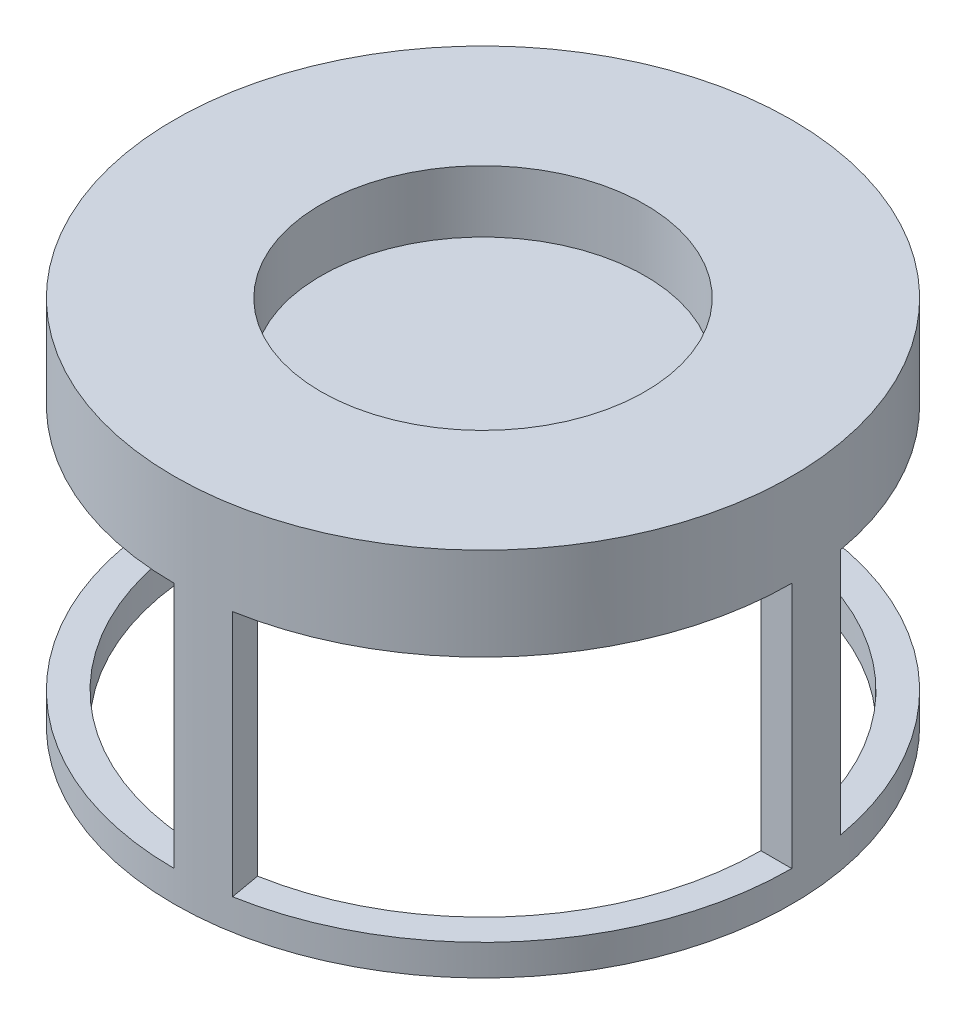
ISO-10303-21;
HEADER;
FILE_DESCRIPTION(('STEP AP214'),'2;1');
FILE_NAME('part.step','',(''),(''),'','','');
FILE_SCHEMA(('AUTOMOTIVE_DESIGN { 1 0 10303 214 1 1 1 1 }'));
ENDSEC;
DATA;
#1=APPLICATION_CONTEXT('core data for automotive mechanical design processes');
#2=APPLICATION_PROTOCOL_DEFINITION('international standard','automotive_design',2000,#1);
#3=PRODUCT_CONTEXT('',#1,'mechanical');
#4=PRODUCT('Part','Part','',(#3));
#5=PRODUCT_RELATED_PRODUCT_CATEGORY('part','',(#4));
#6=PRODUCT_DEFINITION_FORMATION('','',#4);
#7=PRODUCT_DEFINITION_CONTEXT('part definition',#1,'design');
#8=PRODUCT_DEFINITION('design','',#6,#7);
#9=PRODUCT_DEFINITION_SHAPE('','',#8);
#10=(LENGTH_UNIT() NAMED_UNIT(*) SI_UNIT(.MILLI.,.METRE.));
#11=(NAMED_UNIT(*) PLANE_ANGLE_UNIT() SI_UNIT($,.RADIAN.));
#12=(NAMED_UNIT(*) SI_UNIT($,.STERADIAN.) SOLID_ANGLE_UNIT());
#13=UNCERTAINTY_MEASURE_WITH_UNIT(LENGTH_MEASURE(1.E-05),#10,'distance_accuracy_value','');
#14=(GEOMETRIC_REPRESENTATION_CONTEXT(3) GLOBAL_UNCERTAINTY_ASSIGNED_CONTEXT((#13)) GLOBAL_UNIT_ASSIGNED_CONTEXT((#10,
#11,#12)) REPRESENTATION_CONTEXT('',''));
#15=CARTESIAN_POINT('',(0.,0.,0.));
#16=DIRECTION('',(0.,0.,1.));
#17=DIRECTION('',(1.,0.,0.));
#18=AXIS2_PLACEMENT_3D('',#15,#16,#17);
#19=CARTESIAN_POINT('',(0.,0.,0.));
#20=DIRECTION('',(0.,-1.,0.));
#21=DIRECTION('',(0.,0.,-1.));
#22=AXIS2_PLACEMENT_3D('',#19,#20,#21);
#23=PLANE('',#22);
#24=CARTESIAN_POINT('',(0.,0.,0.));
#25=DIRECTION('',(0.,-1.,0.));
#26=DIRECTION('',(0.,0.,-1.));
#27=AXIS2_PLACEMENT_3D('',#24,#25,#26);
#28=CIRCLE('',#27,22.86);
#29=CARTESIAN_POINT('',(0.,0.,-22.86));
#30=VERTEX_POINT('',#29);
#31=CARTESIAN_POINT('',(22.5127052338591,0.,-3.96959734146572));
#32=VERTEX_POINT('',#31);
#33=EDGE_CURVE('E51',#30,#32,#28,.T.);
#34=ORIENTED_EDGE('',*,*,#33,.F.);
#35=DIRECTION('',(0.,0.,1.));
#36=VECTOR('',#35,1.);
#37=CARTESIAN_POINT('',(0.,0.,0.));
#38=LINE('',#37,#36);
#39=CARTESIAN_POINT('',(2.66050878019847E-13,0.,-25.4));
#40=VERTEX_POINT('',#39);
#41=EDGE_CURVE('E156',#40,#30,#38,.T.);
#42=ORIENTED_EDGE('',*,*,#41,.F.);
#43=CARTESIAN_POINT('',(0.,0.,0.));
#44=DIRECTION('',(0.,-1.,0.));
#45=DIRECTION('',(0.,0.,-1.));
#46=AXIS2_PLACEMENT_3D('',#43,#44,#45);
#47=CIRCLE('',#46,25.4);
#48=CARTESIAN_POINT('',(25.0141169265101,0.,-4.41066371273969));
#49=VERTEX_POINT('',#48);
#50=EDGE_CURVE('E185',#40,#49,#47,.T.);
#51=ORIENTED_EDGE('',*,*,#50,.T.);
#52=DIRECTION('',(-0.98480775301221,0.,0.173648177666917));
#53=VECTOR('',#52,1.);
#54=CARTESIAN_POINT('',(0.,0.,0.));
#55=LINE('',#54,#53);
#56=EDGE_CURVE('E159',#49,#32,#55,.T.);
#57=ORIENTED_EDGE('',*,*,#56,.T.);
#58=EDGE_LOOP('',(#34,#42,#51,#57));
#59=FACE_BOUND('',#58,.T.);
#60=ADVANCED_FACE('F40',(#59),#23,.T.);
#61=CARTESIAN_POINT('',(22.86,0.,0.));
#62=VERTEX_POINT('',#61);
#63=CARTESIAN_POINT('',(3.96959734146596,0.,22.5127052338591));
#64=VERTEX_POINT('',#63);
#65=EDGE_CURVE('E11',#62,#64,#28,.T.);
#66=ORIENTED_EDGE('',*,*,#65,.F.);
#67=DIRECTION('',(-1.,0.,0.));
#68=VECTOR('',#67,1.);
#69=CARTESIAN_POINT('',(0.,0.,0.));
#70=LINE('',#69,#68);
#71=CARTESIAN_POINT('',(25.4,0.,0.));
#72=VERTEX_POINT('',#71);
#73=EDGE_CURVE('E241',#72,#62,#70,.T.);
#74=ORIENTED_EDGE('',*,*,#73,.F.);
#75=CARTESIAN_POINT('',(0.,0.,0.));
#76=DIRECTION('',(0.,-1.,0.));
#77=DIRECTION('',(1.,0.,0.));
#78=AXIS2_PLACEMENT_3D('',#75,#76,#77);
#79=CIRCLE('',#78,25.4);
#80=CARTESIAN_POINT('',(4.41066371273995,0.,25.0141169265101));
#81=VERTEX_POINT('',#80);
#82=EDGE_CURVE('E260',#72,#81,#79,.T.);
#83=ORIENTED_EDGE('',*,*,#82,.T.);
#84=DIRECTION('',(-0.173648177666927,0.,-0.984807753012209));
#85=VECTOR('',#84,1.);
#86=CARTESIAN_POINT('',(0.,0.,0.));
#87=LINE('',#86,#85);
#88=EDGE_CURVE('E247',#81,#64,#87,.T.);
#89=ORIENTED_EDGE('',*,*,#88,.T.);
#90=EDGE_LOOP('',(#66,#74,#83,#89));
#91=FACE_BOUND('',#90,.T.);
#92=ADVANCED_FACE('F315',(#91),#23,.T.);
#93=CARTESIAN_POINT('',(0.,0.,22.86));
#94=VERTEX_POINT('',#93);
#95=CARTESIAN_POINT('',(-22.5127052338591,0.,3.96959734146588));
#96=VERTEX_POINT('',#95);
#97=EDGE_CURVE('E49',#94,#96,#28,.T.);
#98=ORIENTED_EDGE('',*,*,#97,.F.);
#99=DIRECTION('',(0.,0.,-1.));
#100=VECTOR('',#99,1.);
#101=CARTESIAN_POINT('',(0.,0.,0.));
#102=LINE('',#101,#100);
#103=CARTESIAN_POINT('',(0.,0.,25.4));
#104=VERTEX_POINT('',#103);
#105=EDGE_CURVE('E215',#104,#94,#102,.T.);
#106=ORIENTED_EDGE('',*,*,#105,.F.);
#107=CARTESIAN_POINT('',(0.,0.,0.));
#108=DIRECTION('',(0.,-1.,0.));
#109=DIRECTION('',(0.,0.,-1.));
#110=AXIS2_PLACEMENT_3D('',#107,#108,#109);
#111=CIRCLE('',#110,25.4);
#112=CARTESIAN_POINT('',(-25.0141169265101,0.,4.41066371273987));
#113=VERTEX_POINT('',#112);
#114=EDGE_CURVE('E234',#104,#113,#111,.T.);
#115=ORIENTED_EDGE('',*,*,#114,.T.);
#116=DIRECTION('',(0.984807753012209,0.,-0.173648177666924));
#117=VECTOR('',#116,1.);
#118=CARTESIAN_POINT('',(0.,0.,0.));
#119=LINE('',#118,#117);
#120=EDGE_CURVE('E221',#113,#96,#119,.T.);
#121=ORIENTED_EDGE('',*,*,#120,.T.);
#122=EDGE_LOOP('',(#98,#106,#115,#121));
#123=FACE_BOUND('',#122,.T.);
#124=ADVANCED_FACE('F321',(#123),#23,.T.);
#125=CARTESIAN_POINT('',(0.,7.62,0.));
#126=DIRECTION('',(0.,-1.,0.));
#127=DIRECTION('',(0.,0.,-1.));
#128=AXIS2_PLACEMENT_3D('',#125,#126,#127);
#129=CYLINDRICAL_SURFACE('',#128,25.4);
#130=CARTESIAN_POINT('',(0.,-20.32,0.));
#131=DIRECTION('',(0.,1.,0.));
#132=DIRECTION('',(0.,0.,1.));
#133=AXIS2_PLACEMENT_3D('',#130,#131,#132);
#134=CIRCLE('',#133,25.4);
#135=CARTESIAN_POINT('',(25.0141169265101,-20.32,-4.4106637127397));
#136=VERTEX_POINT('',#135);
#137=CARTESIAN_POINT('',(2.66050878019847E-13,-20.32,-25.4));
#138=VERTEX_POINT('',#137);
#139=EDGE_CURVE('E187',#136,#138,#134,.T.);
#140=ORIENTED_EDGE('',*,*,#139,.F.);
#141=DIRECTION('',(0.,-1.,0.));
#142=VECTOR('',#141,1.);
#143=CARTESIAN_POINT('',(25.0141169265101,7.62,-4.41066371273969));
#144=LINE('',#143,#142);
#145=EDGE_CURVE('E182',#136,#49,#144,.F.);
#146=ORIENTED_EDGE('',*,*,#145,.T.);
#147=ORIENTED_EDGE('',*,*,#50,.F.);
#148=DIRECTION('',(0.,-1.,0.));
#149=VECTOR('',#148,1.);
#150=CARTESIAN_POINT('',(2.66050878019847E-13,7.62,-25.4));
#151=LINE('',#150,#149);
#152=EDGE_CURVE('E169',#138,#40,#151,.F.);
#153=ORIENTED_EDGE('',*,*,#152,.F.);
#154=EDGE_LOOP('',(#140,#146,#147,#153));
#155=FACE_BOUND('',#154,.T.);
#156=CARTESIAN_POINT('',(0.,-20.32,0.));
#157=DIRECTION('',(0.,1.,0.));
#158=DIRECTION('',(-1.,0.,0.));
#159=AXIS2_PLACEMENT_3D('',#156,#157,#158);
#160=CIRCLE('',#159,25.4);
#161=CARTESIAN_POINT('',(-4.41066371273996,-20.32,-25.0141169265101));
#162=VERTEX_POINT('',#161);
#163=CARTESIAN_POINT('',(-25.4,-20.32,0.));
#164=VERTEX_POINT('',#163);
#165=EDGE_CURVE('E211',#162,#164,#160,.T.);
#166=ORIENTED_EDGE('',*,*,#165,.F.);
#167=DIRECTION('',(0.,-1.,0.));
#168=VECTOR('',#167,1.);
#169=CARTESIAN_POINT('',(-4.41066371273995,7.62,-25.0141169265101));
#170=LINE('',#169,#168);
#171=CARTESIAN_POINT('',(-4.41066371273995,0.,-25.0141169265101));
#172=VERTEX_POINT('',#171);
#173=EDGE_CURVE('E206',#162,#172,#170,.F.);
#174=ORIENTED_EDGE('',*,*,#173,.T.);
#175=CARTESIAN_POINT('',(0.,0.,0.));
#176=DIRECTION('',(0.,-1.,0.));
#177=DIRECTION('',(1.,0.,0.));
#178=AXIS2_PLACEMENT_3D('',#175,#176,#177);
#179=CIRCLE('',#178,25.4);
#180=CARTESIAN_POINT('',(-25.4,0.,0.));
#181=VERTEX_POINT('',#180);
#182=EDGE_CURVE('E209',#181,#172,#179,.T.);
#183=ORIENTED_EDGE('',*,*,#182,.F.);
#184=DIRECTION('',(0.,-1.,0.));
#185=VECTOR('',#184,1.);
#186=CARTESIAN_POINT('',(-25.4,7.62,0.));
#187=LINE('',#186,#185);
#188=EDGE_CURVE('E201',#164,#181,#187,.F.);
#189=ORIENTED_EDGE('',*,*,#188,.F.);
#190=EDGE_LOOP('',(#166,#174,#183,#189));
#191=FACE_BOUND('',#190,.T.);
#192=CARTESIAN_POINT('',(0.,-20.32,0.));
#193=DIRECTION('',(0.,1.,0.));
#194=DIRECTION('',(0.,0.,1.));
#195=AXIS2_PLACEMENT_3D('',#192,#193,#194);
#196=CIRCLE('',#195,25.4);
#197=CARTESIAN_POINT('',(-25.0141169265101,-20.32,4.41066371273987));
#198=VERTEX_POINT('',#197);
#199=CARTESIAN_POINT('',(0.,-20.32,25.4));
#200=VERTEX_POINT('',#199);
#201=EDGE_CURVE('E236',#198,#200,#196,.T.);
#202=ORIENTED_EDGE('',*,*,#201,.F.);
#203=DIRECTION('',(0.,-1.,0.));
#204=VECTOR('',#203,1.);
#205=CARTESIAN_POINT('',(-25.0141169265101,7.62,4.41066371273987));
#206=LINE('',#205,#204);
#207=EDGE_CURVE('E231',#198,#113,#206,.F.);
#208=ORIENTED_EDGE('',*,*,#207,.T.);
#209=ORIENTED_EDGE('',*,*,#114,.F.);
#210=DIRECTION('',(0.,-1.,0.));
#211=VECTOR('',#210,1.);
#212=CARTESIAN_POINT('',(0.,7.62,25.4));
#213=LINE('',#212,#211);
#214=EDGE_CURVE('E226',#200,#104,#213,.F.);
#215=ORIENTED_EDGE('',*,*,#214,.F.);
#216=EDGE_LOOP('',(#202,#208,#209,#215));
#217=FACE_BOUND('',#216,.T.);
#218=CARTESIAN_POINT('',(0.,-20.32,0.));
#219=DIRECTION('',(0.,1.,0.));
#220=DIRECTION('',(-1.,0.,0.));
#221=AXIS2_PLACEMENT_3D('',#218,#219,#220);
#222=CIRCLE('',#221,25.4);
#223=CARTESIAN_POINT('',(4.41066371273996,-20.32,25.0141169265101));
#224=VERTEX_POINT('',#223);
#225=CARTESIAN_POINT('',(25.4,-20.32,0.));
#226=VERTEX_POINT('',#225);
#227=EDGE_CURVE('E262',#224,#226,#222,.T.);
#228=ORIENTED_EDGE('',*,*,#227,.F.);
#229=DIRECTION('',(0.,-1.,0.));
#230=VECTOR('',#229,1.);
#231=CARTESIAN_POINT('',(4.41066371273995,7.62,25.0141169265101));
#232=LINE('',#231,#230);
#233=EDGE_CURVE('E257',#224,#81,#232,.F.);
#234=ORIENTED_EDGE('',*,*,#233,.T.);
#235=ORIENTED_EDGE('',*,*,#82,.F.);
#236=DIRECTION('',(0.,-1.,0.));
#237=VECTOR('',#236,1.);
#238=CARTESIAN_POINT('',(25.4,7.62,0.));
#239=LINE('',#238,#237);
#240=EDGE_CURVE('E252',#226,#72,#239,.F.);
#241=ORIENTED_EDGE('',*,*,#240,.F.);
#242=EDGE_LOOP('',(#228,#234,#235,#241));
#243=FACE_BOUND('',#242,.T.);
#244=CARTESIAN_POINT('',(0.,7.62,0.));
#245=DIRECTION('',(0.,1.,0.));
#246=DIRECTION('',(0.,0.,1.));
#247=AXIS2_PLACEMENT_3D('',#244,#245,#246);
#248=CIRCLE('',#247,25.4);
#249=CARTESIAN_POINT('',(0.,7.62,25.4));
#250=VERTEX_POINT('',#249);
#251=EDGE_CURVE('E275',#250,#250,#248,.T.);
#252=ORIENTED_EDGE('',*,*,#251,.F.);
#253=EDGE_LOOP('',(#252));
#254=FACE_BOUND('',#253,.T.);
#255=CARTESIAN_POINT('',(0.,-22.86,0.));
#256=DIRECTION('',(0.,-1.,0.));
#257=DIRECTION('',(0.,0.,-1.));
#258=AXIS2_PLACEMENT_3D('',#255,#256,#257);
#259=CIRCLE('',#258,25.4);
#260=CARTESIAN_POINT('',(0.,-22.86,-25.4));
#261=VERTEX_POINT('',#260);
#262=EDGE_CURVE('E268',#261,#261,#259,.T.);
#263=ORIENTED_EDGE('',*,*,#262,.F.);
#264=EDGE_LOOP('',(#263));
#265=FACE_BOUND('',#264,.T.);
#266=ADVANCED_FACE('F42',(#155,#191,#217,#243,#254,#265),#129,.T.);
#267=CARTESIAN_POINT('',(0.,7.62,0.));
#268=DIRECTION('',(0.,1.,0.));
#269=DIRECTION('',(0.,0.,1.));
#270=AXIS2_PLACEMENT_3D('',#267,#268,#269);
#271=PLANE('',#270);
#272=CARTESIAN_POINT('',(0.,7.62,0.));
#273=DIRECTION('',(0.,1.,0.));
#274=DIRECTION('',(0.,0.,1.));
#275=AXIS2_PLACEMENT_3D('',#272,#273,#274);
#276=CIRCLE('',#275,13.335);
#277=CARTESIAN_POINT('',(0.,7.62,13.335));
#278=VERTEX_POINT('',#277);
#279=EDGE_CURVE('E271',#278,#278,#276,.T.);
#280=ORIENTED_EDGE('',*,*,#279,.F.);
#281=EDGE_LOOP('',(#280));
#282=FACE_BOUND('',#281,.T.);
#283=ORIENTED_EDGE('',*,*,#251,.T.);
#284=EDGE_LOOP('',(#283));
#285=FACE_BOUND('',#284,.T.);
#286=ADVANCED_FACE('F341',(#282,#285),#271,.T.);
#287=CARTESIAN_POINT('',(0.,2.54,0.));
#288=DIRECTION('',(0.,1.,0.));
#289=DIRECTION('',(0.,0.,1.));
#290=AXIS2_PLACEMENT_3D('',#287,#288,#289);
#291=CYLINDRICAL_SURFACE('',#290,13.335);
#292=CARTESIAN_POINT('',(0.,2.54,0.));
#293=DIRECTION('',(0.,1.,0.));
#294=DIRECTION('',(0.,0.,1.));
#295=AXIS2_PLACEMENT_3D('',#292,#293,#294);
#296=CIRCLE('',#295,13.335);
#297=CARTESIAN_POINT('',(0.,2.54,13.335));
#298=VERTEX_POINT('',#297);
#299=EDGE_CURVE('E272',#298,#298,#296,.T.);
#300=ORIENTED_EDGE('',*,*,#299,.F.);
#301=EDGE_LOOP('',(#300));
#302=FACE_BOUND('',#301,.T.);
#303=ORIENTED_EDGE('',*,*,#279,.T.);
#304=EDGE_LOOP('',(#303));
#305=FACE_BOUND('',#304,.T.);
#306=ADVANCED_FACE('F375',(#302,#305),#291,.F.);
#307=CARTESIAN_POINT('',(0.,2.54,0.));
#308=DIRECTION('',(0.,1.,0.));
#309=DIRECTION('',(0.,0.,1.));
#310=AXIS2_PLACEMENT_3D('',#307,#308,#309);
#311=PLANE('',#310);
#312=ORIENTED_EDGE('',*,*,#299,.T.);
#313=EDGE_LOOP('',(#312));
#314=FACE_BOUND('',#313,.T.);
#315=ADVANCED_FACE('F369',(#314),#311,.T.);
#316=CARTESIAN_POINT('',(0.,-22.86,0.));
#317=DIRECTION('',(0.,-1.,0.));
#318=DIRECTION('',(0.,0.,-1.));
#319=AXIS2_PLACEMENT_3D('',#316,#317,#318);
#320=PLANE('',#319);
#321=CARTESIAN_POINT('',(0.,-22.86,0.));
#322=DIRECTION('',(0.,-1.,0.));
#323=DIRECTION('',(0.,0.,-1.));
#324=AXIS2_PLACEMENT_3D('',#321,#322,#323);
#325=CIRCLE('',#324,22.86);
#326=CARTESIAN_POINT('',(0.,-22.86,-22.86));
#327=VERTEX_POINT('',#326);
#328=EDGE_CURVE('E265',#327,#327,#325,.T.);
#329=ORIENTED_EDGE('',*,*,#328,.F.);
#330=EDGE_LOOP('',(#329));
#331=FACE_BOUND('',#330,.T.);
#332=ORIENTED_EDGE('',*,*,#262,.T.);
#333=EDGE_LOOP('',(#332));
#334=FACE_BOUND('',#333,.T.);
#335=ADVANCED_FACE('F334',(#331,#334),#320,.T.);
#336=CARTESIAN_POINT('',(0.,0.,0.));
#337=DIRECTION('',(0.,-1.,0.));
#338=DIRECTION('',(0.,0.,-1.));
#339=AXIS2_PLACEMENT_3D('',#336,#337,#338);
#340=CYLINDRICAL_SURFACE('',#339,22.86);
#341=DIRECTION('',(0.,-1.,0.));
#342=VECTOR('',#341,1.);
#343=CARTESIAN_POINT('',(22.86,0.,0.));
#344=LINE('',#343,#342);
#345=CARTESIAN_POINT('',(22.86,-20.32,0.));
#346=VERTEX_POINT('',#345);
#347=EDGE_CURVE('E250',#62,#346,#344,.T.);
#348=ORIENTED_EDGE('',*,*,#347,.F.);
#349=ORIENTED_EDGE('',*,*,#65,.T.);
#350=DIRECTION('',(0.,-1.,0.));
#351=VECTOR('',#350,1.);
#352=CARTESIAN_POINT('',(3.96959734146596,0.,22.5127052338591));
#353=LINE('',#352,#351);
#354=CARTESIAN_POINT('',(3.96959734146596,-20.32,22.5127052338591));
#355=VERTEX_POINT('',#354);
#356=EDGE_CURVE('E254',#64,#355,#353,.T.);
#357=ORIENTED_EDGE('',*,*,#356,.T.);
#358=CARTESIAN_POINT('',(0.,-20.32,0.));
#359=DIRECTION('',(0.,1.,0.));
#360=DIRECTION('',(-1.,0.,0.));
#361=AXIS2_PLACEMENT_3D('',#358,#359,#360);
#362=CIRCLE('',#361,22.86);
#363=EDGE_CURVE('E280',#346,#355,#362,.F.);
#364=ORIENTED_EDGE('',*,*,#363,.F.);
#365=EDGE_LOOP('',(#348,#349,#357,#364));
#366=FACE_BOUND('',#365,.T.);
#367=DIRECTION('',(0.,-1.,0.));
#368=VECTOR('',#367,1.);
#369=CARTESIAN_POINT('',(0.,0.,22.86));
#370=LINE('',#369,#368);
#371=CARTESIAN_POINT('',(0.,-20.32,22.86));
#372=VERTEX_POINT('',#371);
#373=EDGE_CURVE('E224',#94,#372,#370,.T.);
#374=ORIENTED_EDGE('',*,*,#373,.F.);
#375=ORIENTED_EDGE('',*,*,#97,.T.);
#376=DIRECTION('',(0.,-1.,0.));
#377=VECTOR('',#376,1.);
#378=CARTESIAN_POINT('',(-22.5127052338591,0.,3.96959734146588));
#379=LINE('',#378,#377);
#380=CARTESIAN_POINT('',(-22.5127052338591,-20.32,3.96959734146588));
#381=VERTEX_POINT('',#380);
#382=EDGE_CURVE('E228',#96,#381,#379,.T.);
#383=ORIENTED_EDGE('',*,*,#382,.T.);
#384=CARTESIAN_POINT('',(0.,-20.32,0.));
#385=DIRECTION('',(0.,1.,0.));
#386=DIRECTION('',(0.,0.,1.));
#387=AXIS2_PLACEMENT_3D('',#384,#385,#386);
#388=CIRCLE('',#387,22.86);
#389=EDGE_CURVE('E282',#372,#381,#388,.F.);
#390=ORIENTED_EDGE('',*,*,#389,.F.);
#391=EDGE_LOOP('',(#374,#375,#383,#390));
#392=FACE_BOUND('',#391,.T.);
#393=DIRECTION('',(0.,-1.,0.));
#394=VECTOR('',#393,1.);
#395=CARTESIAN_POINT('',(-22.86,0.,0.));
#396=LINE('',#395,#394);
#397=CARTESIAN_POINT('',(-22.86,0.,0.));
#398=VERTEX_POINT('',#397);
#399=CARTESIAN_POINT('',(-22.86,-20.32,0.));
#400=VERTEX_POINT('',#399);
#401=EDGE_CURVE('E199',#398,#400,#396,.T.);
#402=ORIENTED_EDGE('',*,*,#401,.F.);
#403=CARTESIAN_POINT('',(-3.96959734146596,0.,-22.5127052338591));
#404=VERTEX_POINT('',#403);
#405=EDGE_CURVE('E165',#398,#404,#28,.T.);
#406=ORIENTED_EDGE('',*,*,#405,.T.);
#407=DIRECTION('',(0.,-1.,0.));
#408=VECTOR('',#407,1.);
#409=CARTESIAN_POINT('',(-3.96959734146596,0.,-22.5127052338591));
#410=LINE('',#409,#408);
#411=CARTESIAN_POINT('',(-3.96959734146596,-20.32,-22.5127052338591));
#412=VERTEX_POINT('',#411);
#413=EDGE_CURVE('E203',#404,#412,#410,.T.);
#414=ORIENTED_EDGE('',*,*,#413,.T.);
#415=CARTESIAN_POINT('',(0.,-20.32,0.));
#416=DIRECTION('',(0.,1.,0.));
#417=DIRECTION('',(-1.,0.,0.));
#418=AXIS2_PLACEMENT_3D('',#415,#416,#417);
#419=CIRCLE('',#418,22.86);
#420=EDGE_CURVE('E283',#400,#412,#419,.F.);
#421=ORIENTED_EDGE('',*,*,#420,.F.);
#422=EDGE_LOOP('',(#402,#406,#414,#421));
#423=FACE_BOUND('',#422,.T.);
#424=ORIENTED_EDGE('',*,*,#33,.T.);
#425=DIRECTION('',(0.,-1.,0.));
#426=VECTOR('',#425,1.);
#427=CARTESIAN_POINT('',(22.5127052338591,0.,-3.96959734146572));
#428=LINE('',#427,#426);
#429=CARTESIAN_POINT('',(22.5127052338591,-20.32,-3.96959734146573));
#430=VERTEX_POINT('',#429);
#431=EDGE_CURVE('E176',#32,#430,#428,.T.);
#432=ORIENTED_EDGE('',*,*,#431,.T.);
#433=CARTESIAN_POINT('',(0.,-20.32,0.));
#434=DIRECTION('',(0.,1.,0.));
#435=DIRECTION('',(0.,0.,1.));
#436=AXIS2_PLACEMENT_3D('',#433,#434,#435);
#437=CIRCLE('',#436,22.86);
#438=CARTESIAN_POINT('',(2.39445790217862E-13,-20.32,-22.86));
#439=VERTEX_POINT('',#438);
#440=EDGE_CURVE('E44',#439,#430,#437,.F.);
#441=ORIENTED_EDGE('',*,*,#440,.F.);
#442=DIRECTION('',(0.,-1.,0.));
#443=VECTOR('',#442,1.);
#444=CARTESIAN_POINT('',(2.39445790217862E-13,0.,-22.86));
#445=LINE('',#444,#443);
#446=EDGE_CURVE('E167',#30,#439,#445,.T.);
#447=ORIENTED_EDGE('',*,*,#446,.F.);
#448=EDGE_LOOP('',(#424,#432,#441,#447));
#449=FACE_BOUND('',#448,.T.);
#450=ORIENTED_EDGE('',*,*,#328,.T.);
#451=EDGE_LOOP('',(#450));
#452=FACE_BOUND('',#451,.T.);
#453=CARTESIAN_POINT('',(0.,5.08,0.));
#454=DIRECTION('',(0.,1.,0.));
#455=DIRECTION('',(0.,0.,1.));
#456=AXIS2_PLACEMENT_3D('',#453,#454,#455);
#457=CIRCLE('',#456,22.86);
#458=CARTESIAN_POINT('',(0.,5.08,22.86));
#459=VERTEX_POINT('',#458);
#460=EDGE_CURVE('E297',#459,#459,#457,.T.);
#461=ORIENTED_EDGE('',*,*,#460,.T.);
#462=EDGE_LOOP('',(#461));
#463=FACE_BOUND('',#462,.T.);
#464=ADVANCED_FACE('F173',(#366,#392,#423,#449,#452,#463),#340,.F.);
#465=ORIENTED_EDGE('',*,*,#405,.F.);
#466=DIRECTION('',(1.,0.,0.));
#467=VECTOR('',#466,1.);
#468=CARTESIAN_POINT('',(0.,0.,0.));
#469=LINE('',#468,#467);
#470=EDGE_CURVE('E190',#181,#398,#469,.T.);
#471=ORIENTED_EDGE('',*,*,#470,.F.);
#472=ORIENTED_EDGE('',*,*,#182,.T.);
#473=DIRECTION('',(0.173648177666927,0.,0.984807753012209));
#474=VECTOR('',#473,1.);
#475=CARTESIAN_POINT('',(0.,0.,0.));
#476=LINE('',#475,#474);
#477=EDGE_CURVE('E196',#172,#404,#476,.T.);
#478=ORIENTED_EDGE('',*,*,#477,.T.);
#479=EDGE_LOOP('',(#465,#471,#472,#478));
#480=FACE_BOUND('',#479,.T.);
#481=ADVANCED_FACE('F317',(#480),#23,.T.);
#482=CARTESIAN_POINT('',(0.,-20.32,0.));
#483=DIRECTION('',(0.,1.,0.));
#484=DIRECTION('',(-1.,0.,0.));
#485=AXIS2_PLACEMENT_3D('',#482,#483,#484);
#486=PLANE('',#485);
#487=ORIENTED_EDGE('',*,*,#227,.T.);
#488=DIRECTION('',(1.,0.,0.));
#489=VECTOR('',#488,1.);
#490=CARTESIAN_POINT('',(0.,-20.32,0.));
#491=LINE('',#490,#489);
#492=EDGE_CURVE('E239',#346,#226,#491,.T.);
#493=ORIENTED_EDGE('',*,*,#492,.F.);
#494=ORIENTED_EDGE('',*,*,#363,.T.);
#495=DIRECTION('',(0.173648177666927,0.,0.984807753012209));
#496=VECTOR('',#495,1.);
#497=CARTESIAN_POINT('',(0.,-20.32,0.));
#498=LINE('',#497,#496);
#499=EDGE_CURVE('E244',#355,#224,#498,.T.);
#500=ORIENTED_EDGE('',*,*,#499,.T.);
#501=EDGE_LOOP('',(#487,#493,#494,#500));
#502=FACE_BOUND('',#501,.T.);
#503=ADVANCED_FACE('F326',(#502),#486,.T.);
#504=CARTESIAN_POINT('',(0.,0.,0.));
#505=DIRECTION('',(-0.984807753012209,0.,0.173648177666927));
#506=DIRECTION('',(0.173648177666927,0.,0.984807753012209));
#507=AXIS2_PLACEMENT_3D('',#504,#505,#506);
#508=PLANE('',#507);
#509=ORIENTED_EDGE('',*,*,#499,.F.);
#510=ORIENTED_EDGE('',*,*,#356,.F.);
#511=ORIENTED_EDGE('',*,*,#88,.F.);
#512=ORIENTED_EDGE('',*,*,#233,.F.);
#513=EDGE_LOOP('',(#509,#510,#511,#512));
#514=FACE_BOUND('',#513,.T.);
#515=ADVANCED_FACE('F332',(#514),#508,.F.);
#516=CARTESIAN_POINT('',(0.,0.,0.));
#517=DIRECTION('',(0.,0.,1.));
#518=DIRECTION('',(1.,0.,0.));
#519=AXIS2_PLACEMENT_3D('',#516,#517,#518);
#520=PLANE('',#519);
#521=ORIENTED_EDGE('',*,*,#240,.T.);
#522=ORIENTED_EDGE('',*,*,#73,.T.);
#523=ORIENTED_EDGE('',*,*,#347,.T.);
#524=ORIENTED_EDGE('',*,*,#492,.T.);
#525=EDGE_LOOP('',(#521,#522,#523,#524));
#526=FACE_BOUND('',#525,.T.);
#527=ADVANCED_FACE('F422',(#526),#520,.T.);
#528=CARTESIAN_POINT('',(0.,-20.32,0.));
#529=DIRECTION('',(0.,1.,0.));
#530=DIRECTION('',(0.,0.,-1.));
#531=AXIS2_PLACEMENT_3D('',#528,#529,#530);
#532=PLANE('',#531);
#533=ORIENTED_EDGE('',*,*,#201,.T.);
#534=DIRECTION('',(0.,0.,1.));
#535=VECTOR('',#534,1.);
#536=CARTESIAN_POINT('',(0.,-20.32,0.));
#537=LINE('',#536,#535);
#538=EDGE_CURVE('E213',#372,#200,#537,.T.);
#539=ORIENTED_EDGE('',*,*,#538,.F.);
#540=ORIENTED_EDGE('',*,*,#389,.T.);
#541=DIRECTION('',(-0.984807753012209,0.,0.173648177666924));
#542=VECTOR('',#541,1.);
#543=CARTESIAN_POINT('',(0.,-20.32,0.));
#544=LINE('',#543,#542);
#545=EDGE_CURVE('E218',#381,#198,#544,.T.);
#546=ORIENTED_EDGE('',*,*,#545,.T.);
#547=EDGE_LOOP('',(#533,#539,#540,#546));
#548=FACE_BOUND('',#547,.T.);
#549=ADVANCED_FACE('F355',(#548),#532,.T.);
#550=CARTESIAN_POINT('',(0.,0.,0.));
#551=DIRECTION('',(-0.173648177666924,0.,-0.984807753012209));
#552=DIRECTION('',(-0.984807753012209,0.,0.173648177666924));
#553=AXIS2_PLACEMENT_3D('',#550,#551,#552);
#554=PLANE('',#553);
#555=ORIENTED_EDGE('',*,*,#545,.F.);
#556=ORIENTED_EDGE('',*,*,#382,.F.);
#557=ORIENTED_EDGE('',*,*,#120,.F.);
#558=ORIENTED_EDGE('',*,*,#207,.F.);
#559=EDGE_LOOP('',(#555,#556,#557,#558));
#560=FACE_BOUND('',#559,.T.);
#561=ADVANCED_FACE('F358',(#560),#554,.F.);
#562=CARTESIAN_POINT('',(0.,0.,0.));
#563=DIRECTION('',(-1.,0.,0.));
#564=DIRECTION('',(0.,0.,1.));
#565=AXIS2_PLACEMENT_3D('',#562,#563,#564);
#566=PLANE('',#565);
#567=ORIENTED_EDGE('',*,*,#214,.T.);
#568=ORIENTED_EDGE('',*,*,#105,.T.);
#569=ORIENTED_EDGE('',*,*,#373,.T.);
#570=ORIENTED_EDGE('',*,*,#538,.T.);
#571=EDGE_LOOP('',(#567,#568,#569,#570));
#572=FACE_BOUND('',#571,.T.);
#573=ADVANCED_FACE('F349',(#572),#566,.T.);
#574=CARTESIAN_POINT('',(0.,-20.32,0.));
#575=DIRECTION('',(0.,1.,0.));
#576=DIRECTION('',(1.,0.,0.));
#577=AXIS2_PLACEMENT_3D('',#574,#575,#576);
#578=PLANE('',#577);
#579=ORIENTED_EDGE('',*,*,#165,.T.);
#580=DIRECTION('',(-1.,0.,0.));
#581=VECTOR('',#580,1.);
#582=CARTESIAN_POINT('',(0.,-20.32,0.));
#583=LINE('',#582,#581);
#584=EDGE_CURVE('E66',#400,#164,#583,.T.);
#585=ORIENTED_EDGE('',*,*,#584,.F.);
#586=ORIENTED_EDGE('',*,*,#420,.T.);
#587=DIRECTION('',(-0.173648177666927,0.,-0.984807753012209));
#588=VECTOR('',#587,1.);
#589=CARTESIAN_POINT('',(0.,-20.32,0.));
#590=LINE('',#589,#588);
#591=EDGE_CURVE('E193',#412,#162,#590,.T.);
#592=ORIENTED_EDGE('',*,*,#591,.T.);
#593=EDGE_LOOP('',(#579,#585,#586,#592));
#594=FACE_BOUND('',#593,.T.);
#595=ADVANCED_FACE('F454',(#594),#578,.T.);
#596=CARTESIAN_POINT('',(0.,0.,0.));
#597=DIRECTION('',(0.984807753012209,0.,-0.173648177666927));
#598=DIRECTION('',(-0.173648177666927,0.,-0.984807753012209));
#599=AXIS2_PLACEMENT_3D('',#596,#597,#598);
#600=PLANE('',#599);
#601=ORIENTED_EDGE('',*,*,#591,.F.);
#602=ORIENTED_EDGE('',*,*,#413,.F.);
#603=ORIENTED_EDGE('',*,*,#477,.F.);
#604=ORIENTED_EDGE('',*,*,#173,.F.);
#605=EDGE_LOOP('',(#601,#602,#603,#604));
#606=FACE_BOUND('',#605,.T.);
#607=ADVANCED_FACE('F462',(#606),#600,.F.);
#608=CARTESIAN_POINT('',(0.,0.,0.));
#609=DIRECTION('',(0.,0.,-1.));
#610=DIRECTION('',(-1.,0.,0.));
#611=AXIS2_PLACEMENT_3D('',#608,#609,#610);
#612=PLANE('',#611);
#613=ORIENTED_EDGE('',*,*,#188,.T.);
#614=ORIENTED_EDGE('',*,*,#470,.T.);
#615=ORIENTED_EDGE('',*,*,#401,.T.);
#616=ORIENTED_EDGE('',*,*,#584,.T.);
#617=EDGE_LOOP('',(#613,#614,#615,#616));
#618=FACE_BOUND('',#617,.T.);
#619=ADVANCED_FACE('F312',(#618),#612,.T.);
#620=CARTESIAN_POINT('',(0.,-20.32,0.));
#621=DIRECTION('',(0.,1.,0.));
#622=DIRECTION('',(0.,0.,1.));
#623=AXIS2_PLACEMENT_3D('',#620,#621,#622);
#624=PLANE('',#623);
#625=ORIENTED_EDGE('',*,*,#139,.T.);
#626=DIRECTION('',(0.,0.,-1.));
#627=VECTOR('',#626,1.);
#628=CARTESIAN_POINT('',(0.,-20.32,0.));
#629=LINE('',#628,#627);
#630=EDGE_CURVE('E58',#439,#138,#629,.T.);
#631=ORIENTED_EDGE('',*,*,#630,.F.);
#632=ORIENTED_EDGE('',*,*,#440,.T.);
#633=DIRECTION('',(0.98480775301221,0.,-0.173648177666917));
#634=VECTOR('',#633,1.);
#635=CARTESIAN_POINT('',(0.,-20.32,0.));
#636=LINE('',#635,#634);
#637=EDGE_CURVE('E170',#430,#136,#636,.T.);
#638=ORIENTED_EDGE('',*,*,#637,.T.);
#639=EDGE_LOOP('',(#625,#631,#632,#638));
#640=FACE_BOUND('',#639,.T.);
#641=ADVANCED_FACE('F299',(#640),#624,.T.);
#642=CARTESIAN_POINT('',(0.,0.,0.));
#643=DIRECTION('',(0.173648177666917,0.,0.98480775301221));
#644=DIRECTION('',(0.98480775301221,0.,-0.173648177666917));
#645=AXIS2_PLACEMENT_3D('',#642,#643,#644);
#646=PLANE('',#645);
#647=ORIENTED_EDGE('',*,*,#637,.F.);
#648=ORIENTED_EDGE('',*,*,#431,.F.);
#649=ORIENTED_EDGE('',*,*,#56,.F.);
#650=ORIENTED_EDGE('',*,*,#145,.F.);
#651=EDGE_LOOP('',(#647,#648,#649,#650));
#652=FACE_BOUND('',#651,.T.);
#653=ADVANCED_FACE('F303',(#652),#646,.F.);
#654=CARTESIAN_POINT('',(0.,0.,0.));
#655=DIRECTION('',(1.,0.,0.));
#656=DIRECTION('',(0.,0.,-1.));
#657=AXIS2_PLACEMENT_3D('',#654,#655,#656);
#658=PLANE('',#657);
#659=ORIENTED_EDGE('',*,*,#152,.T.);
#660=ORIENTED_EDGE('',*,*,#41,.T.);
#661=ORIENTED_EDGE('',*,*,#446,.T.);
#662=ORIENTED_EDGE('',*,*,#630,.T.);
#663=EDGE_LOOP('',(#659,#660,#661,#662));
#664=FACE_BOUND('',#663,.T.);
#665=ADVANCED_FACE('F166',(#664),#658,.T.);
#666=CARTESIAN_POINT('',(0.,5.08,0.));
#667=DIRECTION('',(0.,1.,0.));
#668=DIRECTION('',(0.,0.,1.));
#669=AXIS2_PLACEMENT_3D('',#666,#667,#668);
#670=PLANE('',#669);
#671=CARTESIAN_POINT('',(0.,5.08,0.));
#672=DIRECTION('',(0.,1.,0.));
#673=DIRECTION('',(0.,0.,1.));
#674=AXIS2_PLACEMENT_3D('',#671,#672,#673);
#675=CIRCLE('',#674,15.875);
#676=CARTESIAN_POINT('',(0.,5.08,15.875));
#677=VERTEX_POINT('',#676);
#678=EDGE_CURVE('E164',#677,#677,#675,.T.);
#679=ORIENTED_EDGE('',*,*,#678,.T.);
#680=EDGE_LOOP('',(#679));
#681=FACE_BOUND('',#680,.T.);
#682=ORIENTED_EDGE('',*,*,#460,.F.);
#683=EDGE_LOOP('',(#682));
#684=FACE_BOUND('',#683,.T.);
#685=ADVANCED_FACE('F310',(#681,#684),#670,.F.);
#686=CARTESIAN_POINT('',(0.,2.54,0.));
#687=DIRECTION('',(0.,1.,0.));
#688=DIRECTION('',(0.,0.,1.));
#689=AXIS2_PLACEMENT_3D('',#686,#687,#688);
#690=CYLINDRICAL_SURFACE('',#689,15.875);
#691=CARTESIAN_POINT('',(0.,0.,0.));
#692=DIRECTION('',(0.,1.,0.));
#693=DIRECTION('',(0.,0.,1.));
#694=AXIS2_PLACEMENT_3D('',#691,#692,#693);
#695=CIRCLE('',#694,15.875);
#696=CARTESIAN_POINT('',(0.,0.,15.875));
#697=VERTEX_POINT('',#696);
#698=EDGE_CURVE('E295',#697,#697,#695,.T.);
#699=ORIENTED_EDGE('',*,*,#698,.T.);
#700=EDGE_LOOP('',(#699));
#701=FACE_BOUND('',#700,.T.);
#702=ORIENTED_EDGE('',*,*,#678,.F.);
#703=EDGE_LOOP('',(#702));
#704=FACE_BOUND('',#703,.T.);
#705=ADVANCED_FACE('F498',(#701,#704),#690,.T.);
#706=CARTESIAN_POINT('',(0.,0.,0.));
#707=DIRECTION('',(0.,1.,0.));
#708=DIRECTION('',(0.,0.,1.));
#709=AXIS2_PLACEMENT_3D('',#706,#707,#708);
#710=PLANE('',#709);
#711=ORIENTED_EDGE('',*,*,#698,.F.);
#712=EDGE_LOOP('',(#711));
#713=FACE_BOUND('',#712,.T.);
#714=ADVANCED_FACE('F507',(#713),#710,.F.);
#715=CLOSED_SHELL('',(#60,#92,#124,#266,#286,#306,#315,#335,#464,#481,#503,#515,#527,#549,#561,
#573,#595,#607,#619,#641,#653,#665,#685,#705,#714));
#716=MANIFOLD_SOLID_BREP('B2',#715);
#717=ADVANCED_BREP_SHAPE_REPRESENTATION('',(#18,#716),#14);
#718=SHAPE_DEFINITION_REPRESENTATION(#9,#717);
ENDSEC;
END-ISO-10303-21;
